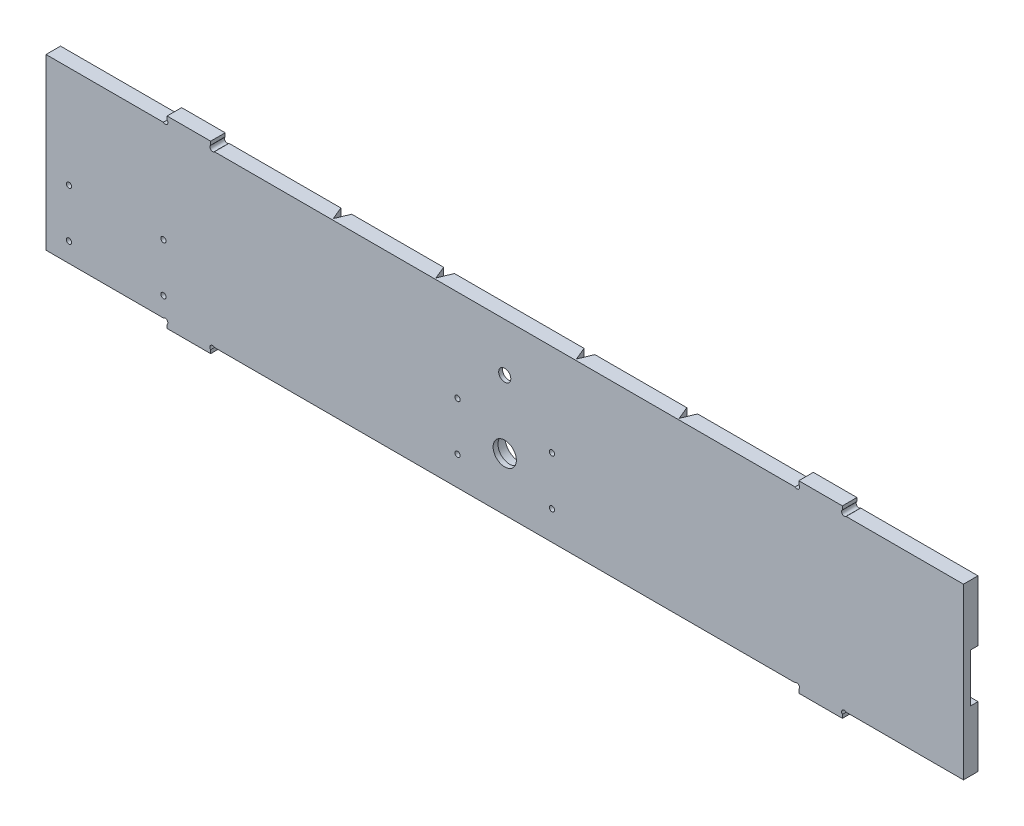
from build123d import *

# Parameters (mm, degrees)
ESQUISSE1_R             = 4.8
ESQUISSE1_R_2           = 2.5
ESQUISSE1_R_3           = 1.1
BOSS_EXTRU_1_DEPTH      = 6
ESQUISSE2_R             = 5.95
ENL_V_MAT_EXTRU_1_DEPTH = 4
ENL_V_MAT_EXTRU_2_DEPTH = 3
ENL_V_MAT_EXTRU_3_DEPTH = 386.875497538
ESQUISSE5_R             = 12
ENL_V_MAT_EXTRU_4_DEPTH = 4.4


with BuildPart() as part:
    # Esquisse1 → Boss.-Extru.1 (new body)
    with BuildSketch(Plane.XY):
        with BuildLine():
            Line((50, 74.555634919), (50, 76))
            Line((50, 76), (68, 76))
            Line((68, 76), (68, 74.555634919))
            ThreePointArc((68, 74.555634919), (68, 73), (69.555634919, 73))
            Line((69.555634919, 73), (309.304365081, 73))
            ThreePointArc((309.304365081, 73), (310.86, 73), (310.86, 74.555634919))
            Line((310.86, 74.555634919), (310.86, 76))
            Line((310.86, 76), (328.86, 76))
            Line((328.86, 76), (328.86, 74.555634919))
            ThreePointArc((328.86, 74.555634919), (328.86, 73), (330.415634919, 73))
            Line((330.415634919, 73), (378.86, 73))
            Line((378.86, 73), (378.86, 3))
            Line((378.86, 3), (330.415634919, 3))
            ThreePointArc((330.415634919, 3), (328.86, 3), (328.86, 1.444365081))
            Line((328.86, 1.444365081), (328.86, 0))
            Line((328.86, 0), (310.86, 0))
            Line((310.86, 0), (310.86, 1.444365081))
            ThreePointArc((310.86, 1.444365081), (310.86, 3), (309.304365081, 3))
            Line((309.304365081, 3), (69.555634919, 3))
            ThreePointArc((69.555634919, 3), (68, 3), (68, 1.444365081))
            Line((68, 1.444365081), (68, 0))
            Line((68, 0), (50, 0))
            Line((50, 0), (50, 1.444365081))
            ThreePointArc((50, 1.444365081), (50, 3), (48.444365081, 3))
            Line((48.444365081, 3), (0, 3))
            Line((0, 3), (0, 73))
            Line((0, 73), (48.444365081, 73))
            ThreePointArc((48.444365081, 73), (50, 73), (50, 74.555634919))
        make_face()
        with Locations((189.43, 25)):
            Circle(ESQUISSE1_R, mode=Mode.SUBTRACT)
        with Locations((189.43, 53)):
            Circle(ESQUISSE1_R_2, mode=Mode.SUBTRACT)
        with Locations((208.93, 15)):
            Circle(ESQUISSE1_R_3, mode=Mode.SUBTRACT)
        with Locations(Location((169.93, 15, 0), (0, 0, 180))):
            Circle(ESQUISSE1_R_3, mode=Mode.SUBTRACT)
        with Locations(Location((208.93, 35, 0), (0, 0, 180))):
            Circle(ESQUISSE1_R_3, mode=Mode.SUBTRACT)
        with Locations((169.93, 35)):
            Circle(ESQUISSE1_R_3, mode=Mode.SUBTRACT)
        with Locations((48.5, 11)):
            Circle(ESQUISSE1_R_3, mode=Mode.SUBTRACT)
        with Locations(Location((9.5, 11, 0), (0, 0, 180))):
            Circle(ESQUISSE1_R_3, mode=Mode.SUBTRACT)
        with Locations((9.5, 31)):
            Circle(ESQUISSE1_R_3, mode=Mode.SUBTRACT)
        with Locations(Location((48.5, 31, 0), (0, 0, 180))):
            Circle(ESQUISSE1_R_3, mode=Mode.SUBTRACT)
    extrude(amount=BOSS_EXTRU_1_DEPTH)

    # Esquisse2 → Enl_v. mat.-Extru.1 (cut)
    with BuildSketch(Plane(origin=(0, 0, 0), x_dir=(-1, 0, 0), z_dir=(0, 0, -1))):
        with Locations((-189.43, 25)):
            Circle(ESQUISSE2_R)
    extrude(amount=-ENL_V_MAT_EXTRU_1_DEPTH, mode=Mode.SUBTRACT)

    # Esquisse3 → Enl_v. mat.-Extru.2 (cut)
    with BuildSketch(Plane(origin=(0, 0, 0), x_dir=(-1, 0, 0), z_dir=(0, 0, -1))):
        with BuildLine():
            Line((-372.86, 45.7372583), (-372.86, 30.2627417))
            ThreePointArc((-372.86, 30.2627417), (-372.86, 28), (-375.1227417, 28))
            Line((-375.1227417, 28), (-378.86, 28))
            Line((-378.86, 28), (-378.86, 48))
            Line((-378.86, 48), (-375.1227417, 48))
            ThreePointArc((-375.1227417, 48), (-372.86, 48), (-372.86, 45.7372583))
        make_face()
        with BuildLine():
            Line((0, 28), (-3.7372583, 28))
            ThreePointArc((-3.7372583, 28), (-6, 28), (-6, 30.2627417))
            Line((-6, 30.2627417), (-6, 45.7372583))
            ThreePointArc((-6, 45.7372583), (-6, 48), (-3.7372583, 48))
            Line((-3.7372583, 48), (0, 48))
            Line((0, 48), (0, 28))
        make_face()
    extrude(amount=-ENL_V_MAT_EXTRU_2_DEPTH, mode=Mode.SUBTRACT)

    # Esquisse4 → Enl_v. mat.-Extru.3 (cut, through all)
    with BuildSketch(Plane.XZ.offset(-3)):
        Polygon((260.86, 5.4), (263.180007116, -0.200992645), (258.539992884, -0.200992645), align=None)
        Polygon((216.109992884, -0.200992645), (220.750007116, -0.200992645), (218.43, 5.4), align=None)
        Polygon((160.43, 5.4), (162.750007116, -0.200992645), (158.109992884, -0.200992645), align=None)
        Polygon((115.679992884, -0.200992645), (120.320007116, -0.200992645), (118, 5.4), align=None)
    extrude(amount=-ENL_V_MAT_EXTRU_3_DEPTH, mode=Mode.SUBTRACT)

    # Esquisse5 → Enl_v. mat.-Extru.4 (cut)
    with BuildSketch(Plane(origin=(0, 0, 0), x_dir=(-1, 0, 0), z_dir=(0, 0, -1))):
        with Locations((-189.43, 53)):
            Circle(ESQUISSE5_R)
    extrude(amount=-ENL_V_MAT_EXTRU_4_DEPTH, mode=Mode.SUBTRACT)


solid = part.part
